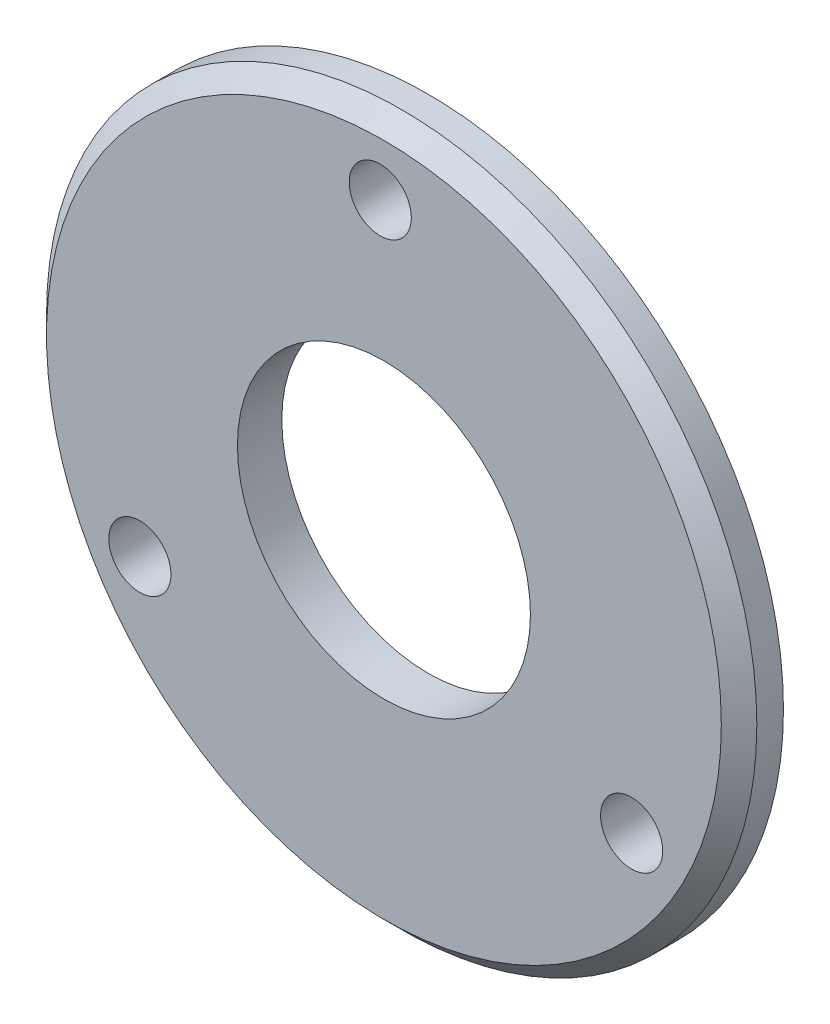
from build123d import *

# Parameters (mm, degrees)
ESQUISSE2_R        = 40
ESQUISSE2_R_2      = 3.5
ESQUISSE2_R_3      = 16.5
BOSS_EXTRU_1_DEPTH = 5
CHANFREIN1_SIZE    = 2


with BuildPart() as part:
    # Esquisse2 → Boss.-Extru.1 (new body)
    with BuildSketch(Plane.XY.offset(-40.405141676)):
        with Locations((-300, 210.710416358)):
            Circle(ESQUISSE2_R)
        with Locations((-300.411388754, 242.687372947)):
            Circle(ESQUISSE2_R_2, mode=Mode.SUBTRACT)
        with Locations((-327.487162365, 194.365664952)):
            Circle(ESQUISSE2_R_2, mode=Mode.SUBTRACT)
        with Locations((-272.101448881, 195.078211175)):
            Circle(ESQUISSE2_R_2, mode=Mode.SUBTRACT)
        with Locations((-300, 210.710416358)):
            Circle(ESQUISSE2_R_3, mode=Mode.SUBTRACT)
    extrude(amount=BOSS_EXTRU_1_DEPTH)

    # Chanfrein1
    chanfrein1_edges = [part.edges().sort_by_distance(p)[0] for p in [
        (-340, 210.710416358, -35.405141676),
    ]]
    chamfer(chanfrein1_edges, length=CHANFREIN1_SIZE)


solid = part.part
